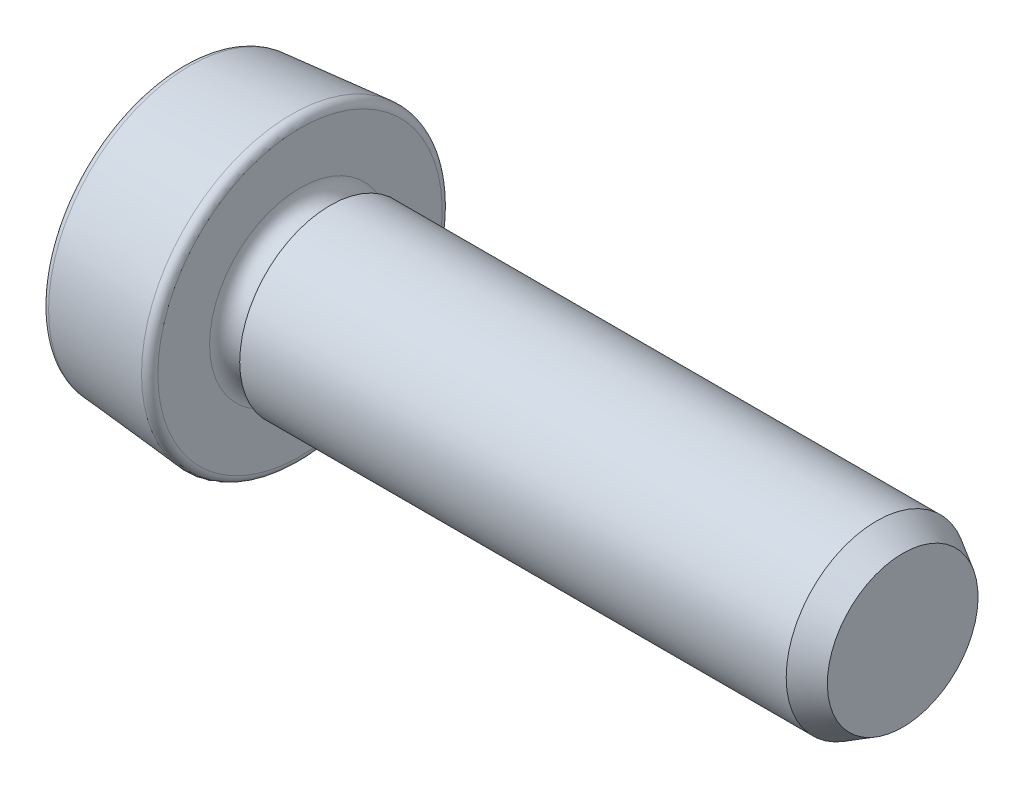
from build123d import *

# Parameters (mm, degrees)
SOCKET_DEPTH = 2
FILLET1_R    = 0.26


with BuildPart() as part:
    # Sketch1 → Base (revolve)
    with BuildSketch(Plane.XY, mode=Mode.PRIVATE) as base_sk:
        Polygon((23.9, 0), (23.9, 3), (3.9, 3), (3.9, 5), (0, 4.658794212), (0, 0), align=None)
    revolve(base_sk.sketch.rotate(Axis((-46.268571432, 0, 0), (1, 0, 0)), 90), axis=Axis((-46.268571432, 0, 0), (1, 0, 0)))

    # Sketch6 → Socket (cut)
    with BuildSketch(Plane(origin=(0, 0, 0), x_dir=(0, 0, -1), z_dir=(1, 0, 0))):
        Polygon((0, 2.075), (-1.797002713, 1.0375), (-1.797002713, -1.0375), (0, -2.075), (1.797002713, -1.0375), (1.797002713, 1.0375), align=None)
    extrude(amount=SOCKET_DEPTH, mode=Mode.SUBTRACT)

    # Sketch9 → Cut-Loft1 section 0
    with BuildSketch(Plane.ZY.offset(-2), mode=Mode.PRIVATE) as cut_loft1_s0:
        with BuildLine():
            Line((0, 2.075), (-1.797002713, 1.0375))
            Line((-1.797002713, 1.0375), (-1.797002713, -1.0375))
            Line((-1.797002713, -1.0375), (0, -2.075))
            Line((0, -2.075), (1.797002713, -1.0375))
            Line((1.797002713, -1.0375), (1.797002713, 1.0375))
            Line((1.797002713, 1.0375), (0, 2.075))
        make_face()
    loft([cut_loft1_s0.sketch, Vertex(3, 0, 0)], mode=Mode.SUBTRACT)

    # Fillet1
    fillet1_edges = [part.edges().sort_by_distance(p)[0] for p in [
        (3.9, 0, -5),
        (0, 0, -4.658794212),
    ]]
    fillet(fillet1_edges, radius=FILLET1_R)

    # Sketch5 → Cut-Revolve1 (revolve, cut)
    with BuildSketch(Plane.XY, mode=Mode.PRIVATE) as cut_revolve1_sk:
        Polygon((23.033974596, -3), (23.9, -2.5), (23.9, -3), align=None)
    revolve(cut_revolve1_sk.sketch.rotate(Axis((25.228193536, 0, 0), (-1, 0, 0)), 180), axis=Axis((25.228193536, 0, 0), (-1, 0, 0)), mode=Mode.SUBTRACT)

    # Sketch3 → Cut-Revolve2 (revolve, cut)
    with BuildSketch(Plane.XY, mode=Mode.PRIVATE) as cut_revolve2_sk:
        with BuildLine():
            Line((3.9, 3), (4.9, 3))
            ThreePointArc((4.9, 3), (4.4, 2.5), (3.9, 3))
        make_face()
    revolve(cut_revolve2_sk.sketch.rotate(Axis((-13.886560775, 0, 0), (-1, 0, 0)), 90), axis=Axis((-13.886560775, 0, 0), (-1, 0, 0)), mode=Mode.SUBTRACT)


solid = part.part
